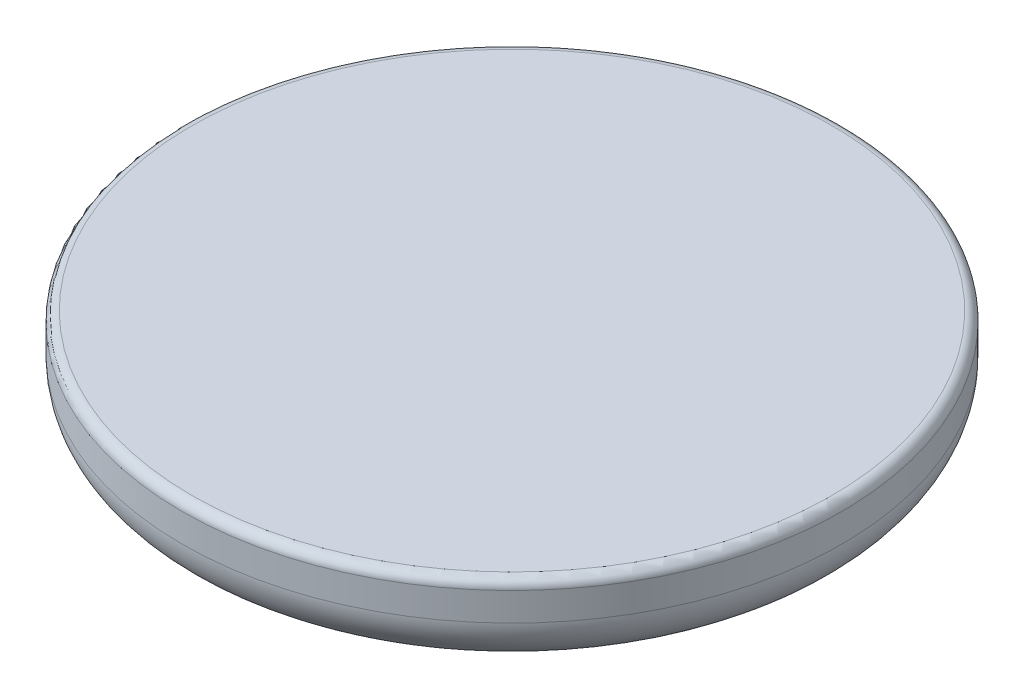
from build123d import *

# Parameters (mm, degrees)
SKETCH1_R           = 35
BOSS_EXTRUDE1_DEPTH = 9
FILLET1_R           = 5
FILLET2_R           = 1


with BuildPart() as part:
    # Sketch1 → Boss-Extrude1 (new body)
    with BuildSketch(Plane(origin=(0, 0, 0), x_dir=(1, 0, 0), z_dir=(0, 1, 0))):
        with Locations(Location((0, 0, 0), (0, 0, 270))):
            Circle(SKETCH1_R)
    extrude(amount=BOSS_EXTRUDE1_DEPTH)

    # Fillet1
    fillet1_edges = [part.edges().sort_by_distance(p)[0] for p in [
        (0, 0, -35),
    ]]
    fillet(fillet1_edges, radius=FILLET1_R)

    # Fillet2
    fillet2_edges = [part.edges().sort_by_distance(p)[0] for p in [
        (0, 9, -35),
    ]]
    fillet(fillet2_edges, radius=FILLET2_R)


solid = part.part
